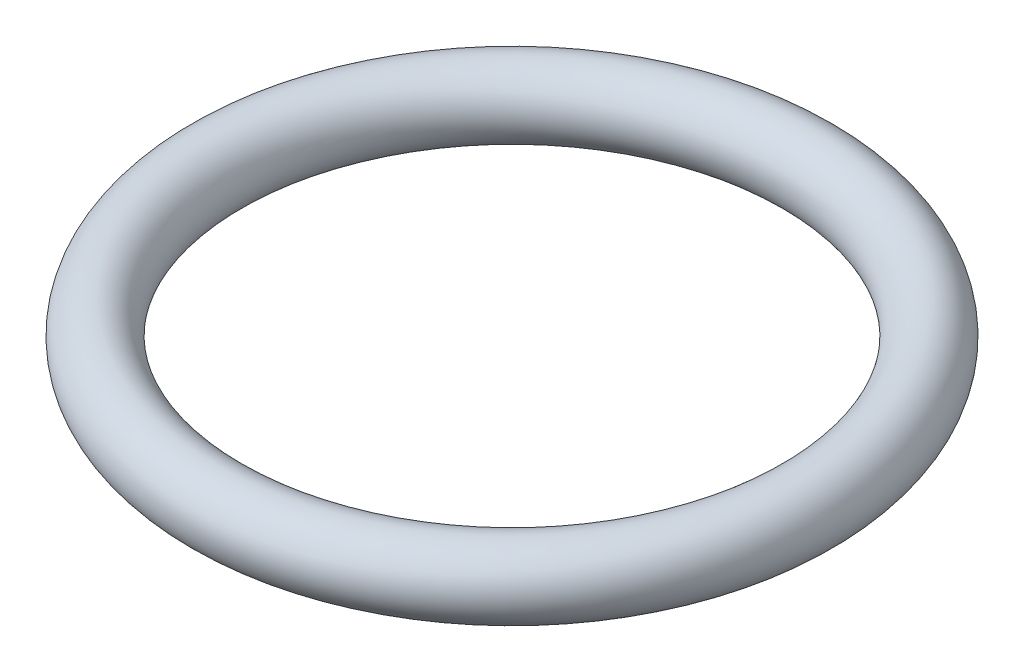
ISO-10303-21;
HEADER;
FILE_DESCRIPTION(('STEP AP214'),'2;1');
FILE_NAME('part.step','',(''),(''),'','','');
FILE_SCHEMA(('AUTOMOTIVE_DESIGN { 1 0 10303 214 1 1 1 1 }'));
ENDSEC;
DATA;
#1=APPLICATION_CONTEXT('core data for automotive mechanical design processes');
#2=APPLICATION_PROTOCOL_DEFINITION('international standard','automotive_design',2000,#1);
#3=PRODUCT_CONTEXT('',#1,'mechanical');
#4=PRODUCT('Part','Part','',(#3));
#5=PRODUCT_RELATED_PRODUCT_CATEGORY('part','',(#4));
#6=PRODUCT_DEFINITION_FORMATION('','',#4);
#7=PRODUCT_DEFINITION_CONTEXT('part definition',#1,'design');
#8=PRODUCT_DEFINITION('design','',#6,#7);
#9=PRODUCT_DEFINITION_SHAPE('','',#8);
#10=(LENGTH_UNIT() NAMED_UNIT(*) SI_UNIT(.MILLI.,.METRE.));
#11=(NAMED_UNIT(*) PLANE_ANGLE_UNIT() SI_UNIT($,.RADIAN.));
#12=(NAMED_UNIT(*) SI_UNIT($,.STERADIAN.) SOLID_ANGLE_UNIT());
#13=UNCERTAINTY_MEASURE_WITH_UNIT(LENGTH_MEASURE(1.E-05),#10,'distance_accuracy_value','');
#14=(GEOMETRIC_REPRESENTATION_CONTEXT(3) GLOBAL_UNCERTAINTY_ASSIGNED_CONTEXT((#13)) GLOBAL_UNIT_ASSIGNED_CONTEXT((#10,
#11,#12)) REPRESENTATION_CONTEXT('',''));
#15=CARTESIAN_POINT('',(0.,0.,0.));
#16=DIRECTION('',(0.,0.,1.));
#17=DIRECTION('',(1.,0.,0.));
#18=AXIS2_PLACEMENT_3D('',#15,#16,#17);
#19=CARTESIAN_POINT('',(0.,0.,0.));
#20=DIRECTION('',(0.,-1.,0.));
#21=DIRECTION('',(0.,0.,-1.));
#22=AXIS2_PLACEMENT_3D('',#19,#20,#21);
#23=TOROIDAL_SURFACE('',#22,8.5,1.);
#24=CARTESIAN_POINT('',(0.,0.,-9.5));
#25=VERTEX_POINT('',#24);
#26=VERTEX_LOOP('',#25);
#27=FACE_BOUND('',#26,.T.);
#28=ADVANCED_FACE('F30',(#27),#23,.T.);
#29=CLOSED_SHELL('',(#28));
#30=MANIFOLD_SOLID_BREP('B2',#29);
#31=ADVANCED_BREP_SHAPE_REPRESENTATION('',(#18,#30),#14);
#32=SHAPE_DEFINITION_REPRESENTATION(#9,#31);
ENDSEC;
END-ISO-10303-21;
